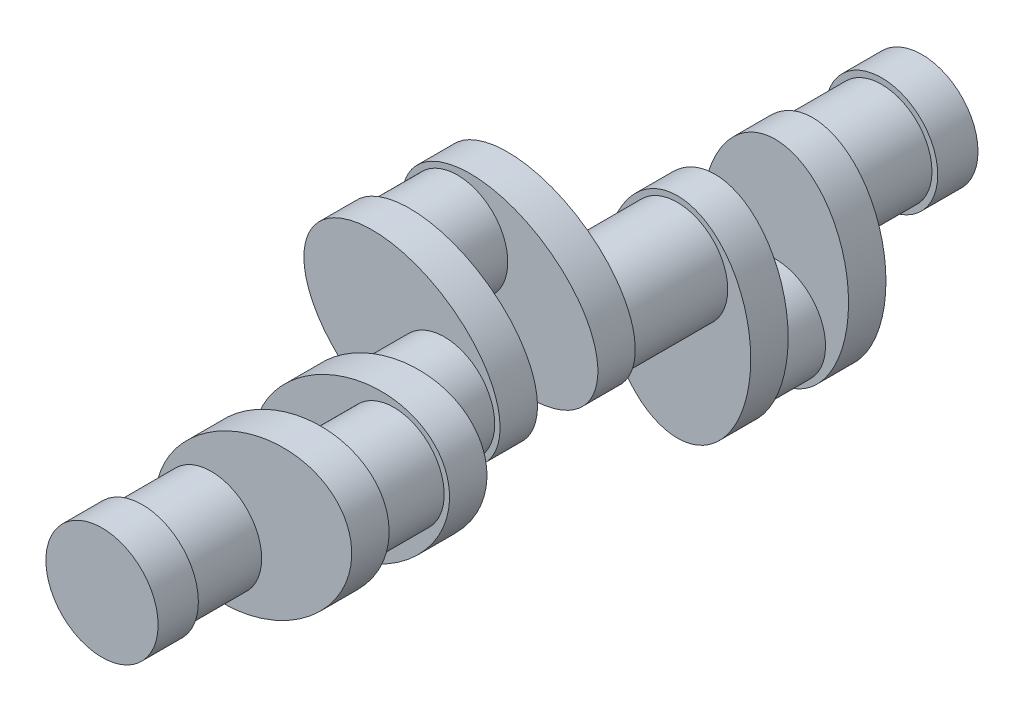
from build123d import *

# Parameters (mm, degrees)
SKETCH1_R             = 19.5
BOSS_EXTRUDE1_DEPTH   = 14
SKETCH2_R             = 17.5
BOSS_EXTRUDE2_DEPTH   = 24
SKETCH3_RX            = 36.5
SKETCH3_RY            = 25.5
BOSS_EXTRUDE3_DEPTH   = 13
SKETCH4_R             = 17.5
BOSS_EXTRUDE4_DEPTH   = 21
SKETCH5_RX            = 36.5
SKETCH5_RY            = 25.5
BOSS_EXTRUDE5_DEPTH   = 13
SKETCH6_R             = 17.5
BOSS_EXTRUDE6_DEPTH   = 34
LPATTERN1_COUNT       = 3
LPATTERN1_PITCH       = 81
SKETCH7_R             = 17.5
BOSS_EXTRUDE7_DEPTH   = 34
SKETCH8_R             = 17.5
BOSS_EXTRUDE8_DEPTH   = 24
SKETCH9_R             = 19.5
BOSS_EXTRUDE9_DEPTH   = 14
BODY_MOVE_COPY2_ANGLE = 120
BODY_MOVE_COPY3_ANGLE = 120


with BuildPart() as part:
    # Sketch1 → Boss-Extrude1 (new body)
    with BuildSketch(Plane.XY):
        Circle(SKETCH1_R)
    extrude(amount=BOSS_EXTRUDE1_DEPTH)

    # Sketch2 → Boss-Extrude2 (add)
    with BuildSketch(Plane.XY.offset(14)):
        Circle(SKETCH2_R)
    extrude(amount=BOSS_EXTRUDE2_DEPTH)


with BuildPart() as body_2:
    # Sketch3 → Boss-Extrude3 (new body)
    with BuildSketch(Plane.XY.offset(38)):
        with Locations(Location((0, -17), (0, 0, 90))):
            Ellipse(SKETCH3_RX, SKETCH3_RY)
    extrude(amount=BOSS_EXTRUDE3_DEPTH)

    # Sketch4 → Boss-Extrude4 (add)
    with BuildSketch(Plane.XY.offset(51)):
        with Locations(Location((0, -34, 0), (0, 0, 180))):
            Circle(SKETCH4_R)
    extrude(amount=BOSS_EXTRUDE4_DEPTH)

    # Sketch5 → Boss-Extrude5 (add)
    with BuildSketch(Plane.XY.offset(72)):
        with Locations(Location((0, -17), (0, 0, 90))):
            Ellipse(SKETCH5_RX, SKETCH5_RY)
    extrude(amount=BOSS_EXTRUDE5_DEPTH)


with BuildPart() as body_3:
    # Sketch6 → Boss-Extrude6 (new body)
    with BuildSketch(Plane.XY.offset(85)):
        Circle(SKETCH6_R)
    extrude(amount=BOSS_EXTRUDE6_DEPTH)


with BuildPart() as lpattern1_1:
    # LPattern1: pattern copy
    add(body_2.part.moved(Location(Vector(0, 0, 1) * (1 * LPATTERN1_PITCH))))


with BuildPart() as lpattern1_2:
    # LPattern1: pattern copy
    add(body_2.part.moved(Location(Vector(0, 0, 1) * (2 * LPATTERN1_PITCH))))


with BuildPart() as body_6:
    # Sketch7 → Boss-Extrude7 (new body)
    with BuildSketch(Plane.XY.offset(166)):
        Circle(SKETCH7_R)
    extrude(amount=BOSS_EXTRUDE7_DEPTH)


with BuildPart() as body_7:
    # Sketch8 → Boss-Extrude8 (new body)
    with BuildSketch(Plane.XY.offset(247)):
        Circle(SKETCH8_R)
    extrude(amount=BOSS_EXTRUDE8_DEPTH)

    # Sketch9 → Boss-Extrude9 (add)
    with BuildSketch(Plane.XY.offset(271)):
        Circle(SKETCH9_R)
    extrude(amount=BOSS_EXTRUDE9_DEPTH)


with BuildPart() as lpattern1_1_1:
    # Body-Move_Copy2: moved
    add(lpattern1_1.part.rotate(Axis((0, 0, 0), (0, 0, -1)), BODY_MOVE_COPY2_ANGLE))


with BuildPart() as lpattern1_2_1:
    # Body-Move_Copy3: moved
    add(lpattern1_2.part.rotate(Axis((0, 0, 0), (0, 0, 1)), BODY_MOVE_COPY3_ANGLE))


with BuildPart() as body_2_1:
    add(body_2.part)

    # Combine1: union body 3, body 6, body 7, LPattern1_1, LPattern1_2, part
    add(body_3.part)
    add(body_6.part)
    add(body_7.part)
    add(lpattern1_1_1.part)
    add(lpattern1_2_1.part)
    add(part.part)


solid = body_2_1.part
